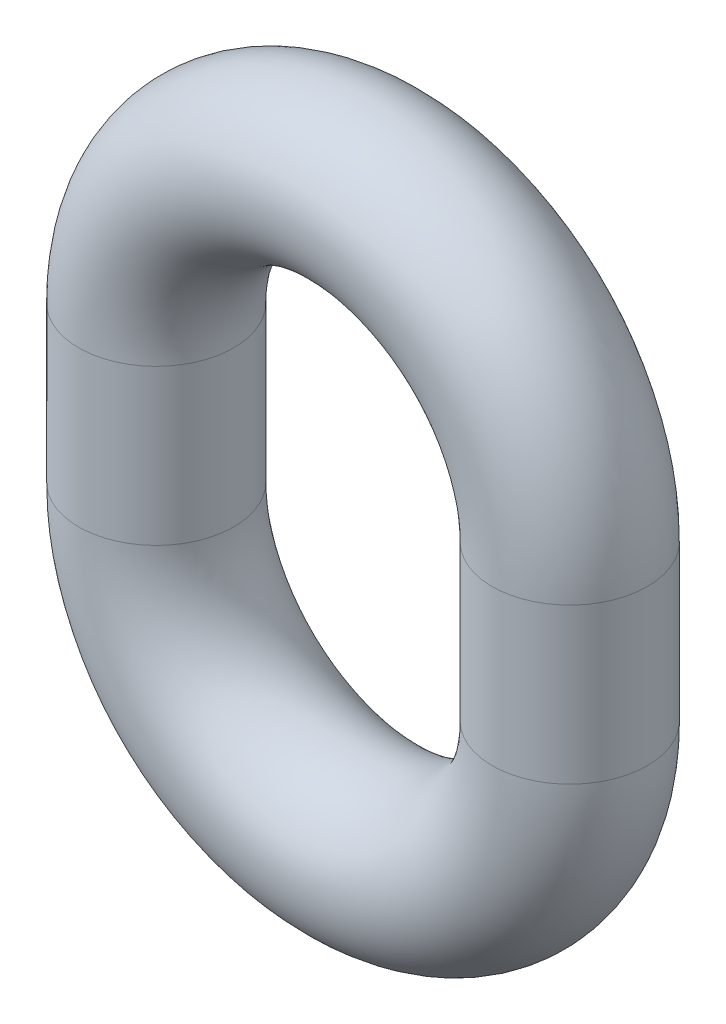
ISO-10303-21;
HEADER;
FILE_DESCRIPTION(('STEP AP214'),'2;1');
FILE_NAME('part.step','',(''),(''),'','','');
FILE_SCHEMA(('AUTOMOTIVE_DESIGN { 1 0 10303 214 1 1 1 1 }'));
ENDSEC;
DATA;
#1=APPLICATION_CONTEXT('core data for automotive mechanical design processes');
#2=APPLICATION_PROTOCOL_DEFINITION('international standard','automotive_design',2000,#1);
#3=PRODUCT_CONTEXT('',#1,'mechanical');
#4=PRODUCT('Part','Part','',(#3));
#5=PRODUCT_RELATED_PRODUCT_CATEGORY('part','',(#4));
#6=PRODUCT_DEFINITION_FORMATION('','',#4);
#7=PRODUCT_DEFINITION_CONTEXT('part definition',#1,'design');
#8=PRODUCT_DEFINITION('design','',#6,#7);
#9=PRODUCT_DEFINITION_SHAPE('','',#8);
#10=(LENGTH_UNIT() NAMED_UNIT(*) SI_UNIT(.MILLI.,.METRE.));
#11=(NAMED_UNIT(*) PLANE_ANGLE_UNIT() SI_UNIT($,.RADIAN.));
#12=(NAMED_UNIT(*) SI_UNIT($,.STERADIAN.) SOLID_ANGLE_UNIT());
#13=UNCERTAINTY_MEASURE_WITH_UNIT(LENGTH_MEASURE(1.E-05),#10,'distance_accuracy_value','');
#14=(GEOMETRIC_REPRESENTATION_CONTEXT(3) GLOBAL_UNCERTAINTY_ASSIGNED_CONTEXT((#13)) GLOBAL_UNIT_ASSIGNED_CONTEXT((#10,
#11,#12)) REPRESENTATION_CONTEXT('',''));
#15=CARTESIAN_POINT('',(0.,0.,0.));
#16=DIRECTION('',(0.,0.,1.));
#17=DIRECTION('',(1.,0.,0.));
#18=AXIS2_PLACEMENT_3D('',#15,#16,#17);
#19=CARTESIAN_POINT('',(0.,9.,0.));
#20=DIRECTION('',(0.,0.,-1.));
#21=DIRECTION('',(-1.,0.,0.));
#22=AXIS2_PLACEMENT_3D('',#19,#20,#21);
#23=TOROIDAL_SURFACE('',#22,24.,9.);
#24=CARTESIAN_POINT('',(-24.,9.00000000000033,0.));
#25=DIRECTION('',(0.,-1.,0.));
#26=DIRECTION('',(0.,0.,1.));
#27=AXIS2_PLACEMENT_3D('',#24,#25,#26);
#28=CIRCLE('',#27,9.);
#29=CARTESIAN_POINT('',(-33.,9.00000000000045,0.));
#30=VERTEX_POINT('',#29);
#31=EDGE_CURVE('E37',#30,#30,#28,.T.);
#32=CARTESIAN_POINT('',(24.,8.99999999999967,0.));
#33=DIRECTION('',(0.,1.,0.));
#34=DIRECTION('',(0.,0.,1.));
#35=AXIS2_PLACEMENT_3D('',#32,#33,#34);
#36=CIRCLE('',#35,9.);
#37=CARTESIAN_POINT('',(33.,8.99999999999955,0.));
#38=VERTEX_POINT('',#37);
#39=EDGE_CURVE('E10',#38,#38,#36,.T.);
#40=CARTESIAN_POINT('',(0.,9.,0.));
#41=DIRECTION('',(0.,0.,-1.));
#42=DIRECTION('',(-1.,0.,0.));
#43=AXIS2_PLACEMENT_3D('',#40,#41,#42);
#44=CIRCLE('',#43,33.);
#45=EDGE_CURVE('',#30,#38,#44,.T.);
#46=ORIENTED_EDGE('',*,*,#31,.F.);
#47=ORIENTED_EDGE('',*,*,#39,.T.);
#48=ORIENTED_EDGE('',*,*,#45,.T.);
#49=ORIENTED_EDGE('',*,*,#45,.F.);
#50=EDGE_LOOP('',(#46,#48,#47,#49));
#51=FACE_BOUND('',#50,.T.);
#52=ADVANCED_FACE('F31',(#51),#23,.T.);
#53=CARTESIAN_POINT('',(-24.,-8.99999999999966,0.));
#54=DIRECTION('',(0.,1.,0.));
#55=DIRECTION('',(-1.,0.,0.));
#56=AXIS2_PLACEMENT_3D('',#53,#54,#55);
#57=CYLINDRICAL_SURFACE('',#56,9.);
#58=CARTESIAN_POINT('',(-24.,-8.99999999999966,0.));
#59=DIRECTION('',(0.,-1.,0.));
#60=DIRECTION('',(0.,0.,1.));
#61=AXIS2_PLACEMENT_3D('',#58,#59,#60);
#62=CIRCLE('',#61,9.);
#63=CARTESIAN_POINT('',(-33.,-8.99999999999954,0.));
#64=VERTEX_POINT('',#63);
#65=EDGE_CURVE('E41',#64,#64,#62,.T.);
#66=ORIENTED_EDGE('',*,*,#65,.F.);
#67=EDGE_LOOP('',(#66));
#68=FACE_BOUND('',#67,.T.);
#69=ORIENTED_EDGE('',*,*,#31,.T.);
#70=EDGE_LOOP('',(#69));
#71=FACE_BOUND('',#70,.T.);
#72=ADVANCED_FACE('F57',(#68,#71),#57,.T.);
#73=CARTESIAN_POINT('',(0.,-9.,0.));
#74=DIRECTION('',(0.,0.,-1.));
#75=DIRECTION('',(-1.,0.,0.));
#76=AXIS2_PLACEMENT_3D('',#73,#74,#75);
#77=TOROIDAL_SURFACE('',#76,24.,9.);
#78=CARTESIAN_POINT('',(24.,-9.,0.));
#79=DIRECTION('',(0.,1.,0.));
#80=DIRECTION('',(0.,0.,1.));
#81=AXIS2_PLACEMENT_3D('',#78,#79,#80);
#82=CIRCLE('',#81,9.);
#83=CARTESIAN_POINT('',(33.,-8.99999999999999,0.));
#84=VERTEX_POINT('',#83);
#85=EDGE_CURVE('E45',#84,#84,#82,.T.);
#86=CARTESIAN_POINT('',(0.,-9.,0.));
#87=DIRECTION('',(0.,0.,-1.));
#88=DIRECTION('',(-1.,0.,0.));
#89=AXIS2_PLACEMENT_3D('',#86,#87,#88);
#90=CIRCLE('',#89,33.);
#91=EDGE_CURVE('',#84,#64,#90,.T.);
#92=ORIENTED_EDGE('',*,*,#85,.F.);
#93=ORIENTED_EDGE('',*,*,#65,.T.);
#94=ORIENTED_EDGE('',*,*,#91,.T.);
#95=ORIENTED_EDGE('',*,*,#91,.F.);
#96=EDGE_LOOP('',(#92,#94,#93,#95));
#97=FACE_BOUND('',#96,.T.);
#98=ADVANCED_FACE('F54',(#97),#77,.T.);
#99=CARTESIAN_POINT('',(24.,-9.,0.));
#100=DIRECTION('',(0.,1.,0.));
#101=DIRECTION('',(0.,0.,1.));
#102=AXIS2_PLACEMENT_3D('',#99,#100,#101);
#103=CYLINDRICAL_SURFACE('',#102,9.);
#104=ORIENTED_EDGE('',*,*,#85,.T.);
#105=EDGE_LOOP('',(#104));
#106=FACE_BOUND('',#105,.T.);
#107=ORIENTED_EDGE('',*,*,#39,.F.);
#108=EDGE_LOOP('',(#107));
#109=FACE_BOUND('',#108,.T.);
#110=ADVANCED_FACE('F51',(#106,#109),#103,.T.);
#111=CLOSED_SHELL('',(#52,#72,#98,#110));
#112=MANIFOLD_SOLID_BREP('B2',#111);
#113=ADVANCED_BREP_SHAPE_REPRESENTATION('',(#18,#112),#14);
#114=SHAPE_DEFINITION_REPRESENTATION(#9,#113);
ENDSEC;
END-ISO-10303-21;
